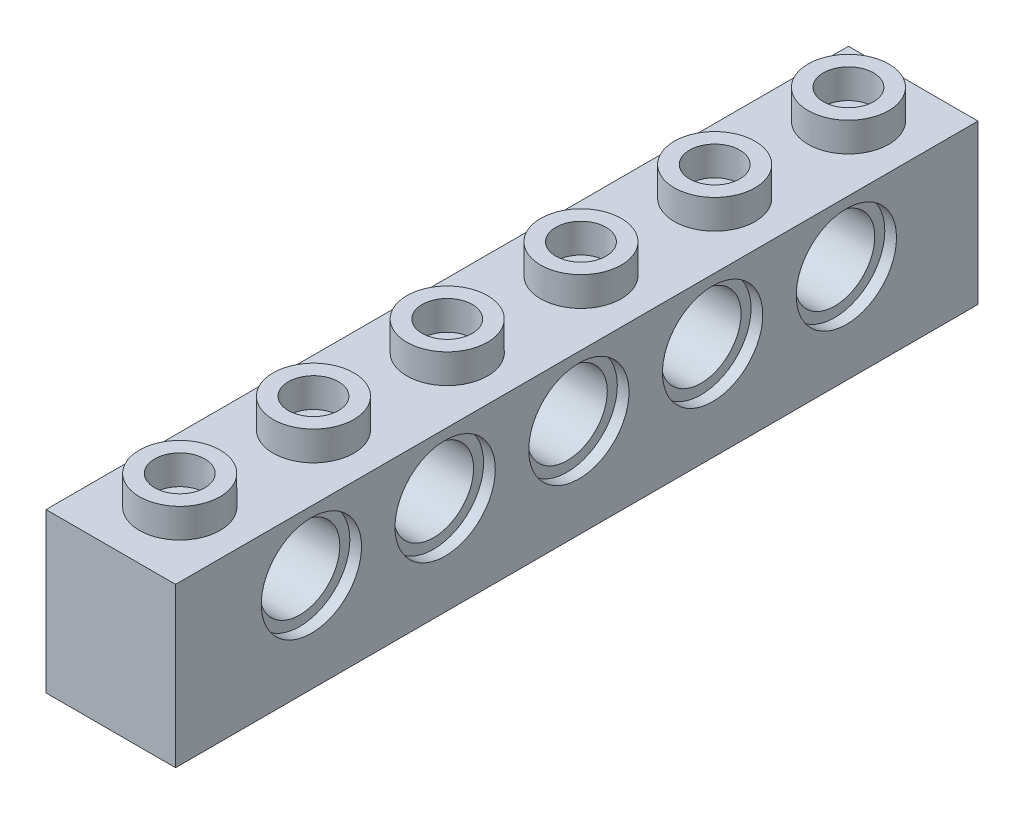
ISO-10303-21;
HEADER;
FILE_DESCRIPTION(('STEP AP214'),'2;1');
FILE_NAME('part.step','',(''),(''),'','','');
FILE_SCHEMA(('AUTOMOTIVE_DESIGN { 1 0 10303 214 1 1 1 1 }'));
ENDSEC;
DATA;
#1=APPLICATION_CONTEXT('core data for automotive mechanical design processes');
#2=APPLICATION_PROTOCOL_DEFINITION('international standard','automotive_design',2000,#1);
#3=PRODUCT_CONTEXT('',#1,'mechanical');
#4=PRODUCT('Part','Part','',(#3));
#5=PRODUCT_RELATED_PRODUCT_CATEGORY('part','',(#4));
#6=PRODUCT_DEFINITION_FORMATION('','',#4);
#7=PRODUCT_DEFINITION_CONTEXT('part definition',#1,'design');
#8=PRODUCT_DEFINITION('design','',#6,#7);
#9=PRODUCT_DEFINITION_SHAPE('','',#8);
#10=(LENGTH_UNIT() NAMED_UNIT(*) SI_UNIT(.MILLI.,.METRE.));
#11=(NAMED_UNIT(*) PLANE_ANGLE_UNIT() SI_UNIT($,.RADIAN.));
#12=(NAMED_UNIT(*) SI_UNIT($,.STERADIAN.) SOLID_ANGLE_UNIT());
#13=UNCERTAINTY_MEASURE_WITH_UNIT(LENGTH_MEASURE(1.E-05),#10,'distance_accuracy_value','');
#14=(GEOMETRIC_REPRESENTATION_CONTEXT(3) GLOBAL_UNCERTAINTY_ASSIGNED_CONTEXT((#13)) GLOBAL_UNIT_ASSIGNED_CONTEXT((#10,
#11,#12)) REPRESENTATION_CONTEXT('',''));
#15=CARTESIAN_POINT('',(0.,0.,0.));
#16=DIRECTION('',(0.,0.,1.));
#17=DIRECTION('',(1.,0.,0.));
#18=AXIS2_PLACEMENT_3D('',#15,#16,#17);
#19=CARTESIAN_POINT('',(-2.425,-3.,1.45));
#20=DIRECTION('',(0.,-1.,0.));
#21=DIRECTION('',(0.,0.,-1.));
#22=AXIS2_PLACEMENT_3D('',#19,#20,#21);
#23=PLANE('',#22);
#24=CARTESIAN_POINT('',(0.,-3.,16.4));
#25=DIRECTION('',(0.,-1.,0.));
#26=DIRECTION('',(0.,0.,-1.));
#27=AXIS2_PLACEMENT_3D('',#24,#25,#26);
#28=CIRCLE('',#27,1.5);
#29=CARTESIAN_POINT('',(0.,-3.,14.9));
#30=VERTEX_POINT('',#29);
#31=EDGE_CURVE('E340',#30,#30,#28,.T.);
#32=ORIENTED_EDGE('',*,*,#31,.F.);
#33=EDGE_LOOP('',(#32));
#34=FACE_BOUND('',#33,.T.);
#35=CARTESIAN_POINT('',(0.,-3.,32.4));
#36=DIRECTION('',(0.,-1.,0.));
#37=DIRECTION('',(0.,0.,-1.));
#38=AXIS2_PLACEMENT_3D('',#35,#36,#37);
#39=CIRCLE('',#38,1.5);
#40=CARTESIAN_POINT('',(0.,-3.,30.9));
#41=VERTEX_POINT('',#40);
#42=EDGE_CURVE('E352',#41,#41,#39,.T.);
#43=ORIENTED_EDGE('',*,*,#42,.F.);
#44=EDGE_LOOP('',(#43));
#45=FACE_BOUND('',#44,.T.);
#46=DIRECTION('',(0.,0.,-1.));
#47=VECTOR('',#46,1.);
#48=CARTESIAN_POINT('',(-2.425,-3.,46.55));
#49=LINE('',#48,#47);
#50=CARTESIAN_POINT('',(-2.425,-3.,46.55));
#51=VERTEX_POINT('',#50);
#52=CARTESIAN_POINT('',(-2.425,-3.,1.45));
#53=VERTEX_POINT('',#52);
#54=EDGE_CURVE('E115',#51,#53,#49,.T.);
#55=ORIENTED_EDGE('',*,*,#54,.T.);
#56=DIRECTION('',(1.,0.,0.));
#57=VECTOR('',#56,1.);
#58=CARTESIAN_POINT('',(-2.425,-3.,1.45));
#59=LINE('',#58,#57);
#60=CARTESIAN_POINT('',(2.425,-3.,1.45));
#61=VERTEX_POINT('',#60);
#62=EDGE_CURVE('E124',#53,#61,#59,.T.);
#63=ORIENTED_EDGE('',*,*,#62,.T.);
#64=DIRECTION('',(0.,0.,1.));
#65=VECTOR('',#64,1.);
#66=CARTESIAN_POINT('',(2.425,-3.,1.45));
#67=LINE('',#66,#65);
#68=CARTESIAN_POINT('',(2.425,-3.,46.55));
#69=VERTEX_POINT('',#68);
#70=EDGE_CURVE('E129',#61,#69,#67,.T.);
#71=ORIENTED_EDGE('',*,*,#70,.T.);
#72=DIRECTION('',(-1.,0.,0.));
#73=VECTOR('',#72,1.);
#74=CARTESIAN_POINT('',(2.425,-3.,46.55));
#75=LINE('',#74,#73);
#76=EDGE_CURVE('E121',#69,#51,#75,.T.);
#77=ORIENTED_EDGE('',*,*,#76,.T.);
#78=EDGE_LOOP('',(#55,#63,#71,#77));
#79=FACE_BOUND('',#78,.T.);
#80=CARTESIAN_POINT('',(0.,-3.,40.4));
#81=DIRECTION('',(0.,-1.,0.));
#82=DIRECTION('',(0.,0.,-1.));
#83=AXIS2_PLACEMENT_3D('',#80,#81,#82);
#84=CIRCLE('',#83,1.5);
#85=CARTESIAN_POINT('',(0.,-3.,38.9));
#86=VERTEX_POINT('',#85);
#87=EDGE_CURVE('E139',#86,#86,#84,.T.);
#88=ORIENTED_EDGE('',*,*,#87,.F.);
#89=EDGE_LOOP('',(#88));
#90=FACE_BOUND('',#89,.T.);
#91=CARTESIAN_POINT('',(0.,-3.,24.4));
#92=DIRECTION('',(0.,-1.,0.));
#93=DIRECTION('',(0.,0.,-1.));
#94=AXIS2_PLACEMENT_3D('',#91,#92,#93);
#95=CIRCLE('',#94,1.5);
#96=CARTESIAN_POINT('',(0.,-3.,22.9));
#97=VERTEX_POINT('',#96);
#98=EDGE_CURVE('E346',#97,#97,#95,.T.);
#99=ORIENTED_EDGE('',*,*,#98,.F.);
#100=EDGE_LOOP('',(#99));
#101=FACE_BOUND('',#100,.T.);
#102=CARTESIAN_POINT('',(0.,-3.,8.4));
#103=DIRECTION('',(0.,-1.,0.));
#104=DIRECTION('',(0.,0.,-1.));
#105=AXIS2_PLACEMENT_3D('',#102,#103,#104);
#106=CIRCLE('',#105,1.5);
#107=CARTESIAN_POINT('',(0.,-3.,6.9));
#108=VERTEX_POINT('',#107);
#109=EDGE_CURVE('E334',#108,#108,#106,.T.);
#110=ORIENTED_EDGE('',*,*,#109,.F.);
#111=EDGE_LOOP('',(#110));
#112=FACE_BOUND('',#111,.T.);
#113=ADVANCED_FACE('F36',(#34,#45,#79,#90,#101,#112),#23,.T.);
#114=CARTESIAN_POINT('',(3.875,4.75,48.));
#115=DIRECTION('',(0.,-1.,0.));
#116=DIRECTION('',(1.,0.,0.));
#117=AXIS2_PLACEMENT_3D('',#114,#115,#116);
#118=PLANE('',#117);
#119=DIRECTION('',(-1.,0.,0.));
#120=VECTOR('',#119,1.);
#121=CARTESIAN_POINT('',(3.875,4.75,0.));
#122=LINE('',#121,#120);
#123=CARTESIAN_POINT('',(3.875,4.75,0.));
#124=VERTEX_POINT('',#123);
#125=CARTESIAN_POINT('',(-3.875,4.75,0.));
#126=VERTEX_POINT('',#125);
#127=EDGE_CURVE('E83',#124,#126,#122,.T.);
#128=ORIENTED_EDGE('',*,*,#127,.T.);
#129=DIRECTION('',(0.,0.,-1.));
#130=VECTOR('',#129,1.);
#131=CARTESIAN_POINT('',(-3.875,4.75,48.));
#132=LINE('',#131,#130);
#133=CARTESIAN_POINT('',(-3.875,4.75,48.));
#134=VERTEX_POINT('',#133);
#135=EDGE_CURVE('E216',#134,#126,#132,.T.);
#136=ORIENTED_EDGE('',*,*,#135,.F.);
#137=DIRECTION('',(-1.,0.,0.));
#138=VECTOR('',#137,1.);
#139=CARTESIAN_POINT('',(3.875,4.75,48.));
#140=LINE('',#139,#138);
#141=CARTESIAN_POINT('',(3.875,4.75,48.));
#142=VERTEX_POINT('',#141);
#143=EDGE_CURVE('E62',#142,#134,#140,.T.);
#144=ORIENTED_EDGE('',*,*,#143,.F.);
#145=DIRECTION('',(0.,0.,-1.));
#146=VECTOR('',#145,1.);
#147=CARTESIAN_POINT('',(3.875,4.75,48.));
#148=LINE('',#147,#146);
#149=EDGE_CURVE('E225',#142,#124,#148,.T.);
#150=ORIENTED_EDGE('',*,*,#149,.T.);
#151=EDGE_LOOP('',(#128,#136,#144,#150));
#152=FACE_BOUND('',#151,.T.);
#153=CARTESIAN_POINT('',(0.,4.75,3.875));
#154=DIRECTION('',(0.,-1.,0.));
#155=DIRECTION('',(1.,0.,0.));
#156=AXIS2_PLACEMENT_3D('',#153,#154,#155);
#157=CIRCLE('',#156,2.415);
#158=CARTESIAN_POINT('',(2.415,4.75,3.875));
#159=VERTEX_POINT('',#158);
#160=EDGE_CURVE('E232',#159,#159,#157,.F.);
#161=ORIENTED_EDGE('',*,*,#160,.F.);
#162=EDGE_LOOP('',(#161));
#163=FACE_BOUND('',#162,.T.);
#164=CARTESIAN_POINT('',(0.,4.75,11.875));
#165=DIRECTION('',(0.,-1.,0.));
#166=DIRECTION('',(1.,0.,0.));
#167=AXIS2_PLACEMENT_3D('',#164,#165,#166);
#168=CIRCLE('',#167,2.415);
#169=CARTESIAN_POINT('',(2.415,4.75,11.875));
#170=VERTEX_POINT('',#169);
#171=EDGE_CURVE('E235',#170,#170,#168,.F.);
#172=ORIENTED_EDGE('',*,*,#171,.F.);
#173=EDGE_LOOP('',(#172));
#174=FACE_BOUND('',#173,.T.);
#175=CARTESIAN_POINT('',(0.,4.75,19.875));
#176=DIRECTION('',(0.,-1.,0.));
#177=DIRECTION('',(1.,0.,0.));
#178=AXIS2_PLACEMENT_3D('',#175,#176,#177);
#179=CIRCLE('',#178,2.415);
#180=CARTESIAN_POINT('',(2.415,4.75,19.875));
#181=VERTEX_POINT('',#180);
#182=EDGE_CURVE('E238',#181,#181,#179,.F.);
#183=ORIENTED_EDGE('',*,*,#182,.F.);
#184=EDGE_LOOP('',(#183));
#185=FACE_BOUND('',#184,.T.);
#186=CARTESIAN_POINT('',(0.,4.75,27.875));
#187=DIRECTION('',(0.,-1.,0.));
#188=DIRECTION('',(1.,0.,0.));
#189=AXIS2_PLACEMENT_3D('',#186,#187,#188);
#190=CIRCLE('',#189,2.415);
#191=CARTESIAN_POINT('',(2.415,4.75,27.875));
#192=VERTEX_POINT('',#191);
#193=EDGE_CURVE('E241',#192,#192,#190,.F.);
#194=ORIENTED_EDGE('',*,*,#193,.F.);
#195=EDGE_LOOP('',(#194));
#196=FACE_BOUND('',#195,.T.);
#197=CARTESIAN_POINT('',(0.,4.75,35.875));
#198=DIRECTION('',(0.,-1.,0.));
#199=DIRECTION('',(1.,0.,0.));
#200=AXIS2_PLACEMENT_3D('',#197,#198,#199);
#201=CIRCLE('',#200,2.415);
#202=CARTESIAN_POINT('',(2.415,4.75,35.875));
#203=VERTEX_POINT('',#202);
#204=EDGE_CURVE('E45',#203,#203,#201,.F.);
#205=ORIENTED_EDGE('',*,*,#204,.F.);
#206=EDGE_LOOP('',(#205));
#207=FACE_BOUND('',#206,.T.);
#208=CARTESIAN_POINT('',(0.,4.75,43.875));
#209=DIRECTION('',(0.,-1.,0.));
#210=DIRECTION('',(1.,0.,0.));
#211=AXIS2_PLACEMENT_3D('',#208,#209,#210);
#212=CIRCLE('',#211,2.415);
#213=CARTESIAN_POINT('',(2.415,4.75,43.875));
#214=VERTEX_POINT('',#213);
#215=EDGE_CURVE('E11',#214,#214,#212,.F.);
#216=ORIENTED_EDGE('',*,*,#215,.F.);
#217=EDGE_LOOP('',(#216));
#218=FACE_BOUND('',#217,.T.);
#219=ADVANCED_FACE('F368',(#152,#163,#174,#185,#196,#207,#218),#118,.F.);
#220=CARTESIAN_POINT('',(-3.875,-4.75,48.));
#221=DIRECTION('',(1.,0.,0.));
#222=DIRECTION('',(0.,0.,-1.));
#223=AXIS2_PLACEMENT_3D('',#220,#221,#222);
#224=PLANE('',#223);
#225=CARTESIAN_POINT('',(-3.875,1.15,7.87499999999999));
#226=DIRECTION('',(-1.,0.,0.));
#227=DIRECTION('',(0.,0.,1.));
#228=AXIS2_PLACEMENT_3D('',#225,#226,#227);
#229=CIRCLE('',#228,3.);
#230=CARTESIAN_POINT('',(-3.875,1.15,10.875));
#231=VERTEX_POINT('',#230);
#232=EDGE_CURVE('E297',#231,#231,#229,.T.);
#233=ORIENTED_EDGE('',*,*,#232,.F.);
#234=EDGE_LOOP('',(#233));
#235=FACE_BOUND('',#234,.T.);
#236=CARTESIAN_POINT('',(-3.875,1.15,15.875));
#237=DIRECTION('',(-1.,0.,0.));
#238=DIRECTION('',(0.,0.,1.));
#239=AXIS2_PLACEMENT_3D('',#236,#237,#238);
#240=CIRCLE('',#239,3.);
#241=CARTESIAN_POINT('',(-3.875,1.15,18.875));
#242=VERTEX_POINT('',#241);
#243=EDGE_CURVE('E303',#242,#242,#240,.T.);
#244=ORIENTED_EDGE('',*,*,#243,.F.);
#245=EDGE_LOOP('',(#244));
#246=FACE_BOUND('',#245,.T.);
#247=CARTESIAN_POINT('',(-3.875,1.15,23.875));
#248=DIRECTION('',(-1.,0.,0.));
#249=DIRECTION('',(0.,0.,1.));
#250=AXIS2_PLACEMENT_3D('',#247,#248,#249);
#251=CIRCLE('',#250,3.);
#252=CARTESIAN_POINT('',(-3.875,1.15,26.875));
#253=VERTEX_POINT('',#252);
#254=EDGE_CURVE('E309',#253,#253,#251,.T.);
#255=ORIENTED_EDGE('',*,*,#254,.F.);
#256=EDGE_LOOP('',(#255));
#257=FACE_BOUND('',#256,.T.);
#258=CARTESIAN_POINT('',(-3.875,1.15,31.875));
#259=DIRECTION('',(-1.,0.,0.));
#260=DIRECTION('',(0.,0.,1.));
#261=AXIS2_PLACEMENT_3D('',#258,#259,#260);
#262=CIRCLE('',#261,3.);
#263=CARTESIAN_POINT('',(-3.875,1.15,34.875));
#264=VERTEX_POINT('',#263);
#265=EDGE_CURVE('E315',#264,#264,#262,.T.);
#266=ORIENTED_EDGE('',*,*,#265,.F.);
#267=EDGE_LOOP('',(#266));
#268=FACE_BOUND('',#267,.T.);
#269=CARTESIAN_POINT('',(-3.875,1.15,39.875));
#270=DIRECTION('',(-1.,0.,0.));
#271=DIRECTION('',(0.,0.,1.));
#272=AXIS2_PLACEMENT_3D('',#269,#270,#271);
#273=CIRCLE('',#272,3.);
#274=CARTESIAN_POINT('',(-3.875,1.15,42.875));
#275=VERTEX_POINT('',#274);
#276=EDGE_CURVE('E328',#275,#275,#273,.T.);
#277=ORIENTED_EDGE('',*,*,#276,.F.);
#278=EDGE_LOOP('',(#277));
#279=FACE_BOUND('',#278,.T.);
#280=DIRECTION('',(0.,-1.,0.));
#281=VECTOR('',#280,1.);
#282=CARTESIAN_POINT('',(-3.875,-4.75,0.));
#283=LINE('',#282,#281);
#284=CARTESIAN_POINT('',(-3.875,-4.75,0.));
#285=VERTEX_POINT('',#284);
#286=EDGE_CURVE('E209',#126,#285,#283,.T.);
#287=ORIENTED_EDGE('',*,*,#286,.T.);
#288=DIRECTION('',(0.,0.,-1.));
#289=VECTOR('',#288,1.);
#290=CARTESIAN_POINT('',(-3.875,-4.75,48.));
#291=LINE('',#290,#289);
#292=CARTESIAN_POINT('',(-3.875,-4.75,48.));
#293=VERTEX_POINT('',#292);
#294=EDGE_CURVE('E230',#293,#285,#291,.T.);
#295=ORIENTED_EDGE('',*,*,#294,.F.);
#296=DIRECTION('',(0.,-1.,0.));
#297=VECTOR('',#296,1.);
#298=CARTESIAN_POINT('',(-3.875,-4.75,48.));
#299=LINE('',#298,#297);
#300=EDGE_CURVE('E210',#134,#293,#299,.T.);
#301=ORIENTED_EDGE('',*,*,#300,.F.);
#302=ORIENTED_EDGE('',*,*,#135,.T.);
#303=EDGE_LOOP('',(#287,#295,#301,#302));
#304=FACE_BOUND('',#303,.T.);
#305=ADVANCED_FACE('F38',(#235,#246,#257,#268,#279,#304),#224,.F.);
#306=CARTESIAN_POINT('',(3.875,-4.75,48.));
#307=DIRECTION('',(0.,1.,0.));
#308=DIRECTION('',(0.,0.,1.));
#309=AXIS2_PLACEMENT_3D('',#306,#307,#308);
#310=PLANE('',#309);
#311=DIRECTION('',(1.,0.,0.));
#312=VECTOR('',#311,1.);
#313=CARTESIAN_POINT('',(-2.425,-4.75,1.45));
#314=LINE('',#313,#312);
#315=CARTESIAN_POINT('',(-2.425,-4.75,1.45));
#316=VERTEX_POINT('',#315);
#317=CARTESIAN_POINT('',(2.425,-4.75,1.45));
#318=VERTEX_POINT('',#317);
#319=EDGE_CURVE('E145',#316,#318,#314,.T.);
#320=ORIENTED_EDGE('',*,*,#319,.F.);
#321=DIRECTION('',(0.,0.,-1.));
#322=VECTOR('',#321,1.);
#323=CARTESIAN_POINT('',(-2.425,-4.75,46.55));
#324=LINE('',#323,#322);
#325=CARTESIAN_POINT('',(-2.425,-4.75,46.55));
#326=VERTEX_POINT('',#325);
#327=EDGE_CURVE('E53',#326,#316,#324,.T.);
#328=ORIENTED_EDGE('',*,*,#327,.F.);
#329=DIRECTION('',(-1.,0.,0.));
#330=VECTOR('',#329,1.);
#331=CARTESIAN_POINT('',(2.425,-4.75,46.55));
#332=LINE('',#331,#330);
#333=CARTESIAN_POINT('',(2.425,-4.75,46.55));
#334=VERTEX_POINT('',#333);
#335=EDGE_CURVE('E133',#334,#326,#332,.T.);
#336=ORIENTED_EDGE('',*,*,#335,.F.);
#337=DIRECTION('',(0.,0.,1.));
#338=VECTOR('',#337,1.);
#339=CARTESIAN_POINT('',(2.425,-4.75,1.45));
#340=LINE('',#339,#338);
#341=EDGE_CURVE('E136',#318,#334,#340,.T.);
#342=ORIENTED_EDGE('',*,*,#341,.F.);
#343=EDGE_LOOP('',(#320,#328,#336,#342));
#344=FACE_BOUND('',#343,.T.);
#345=DIRECTION('',(1.,0.,0.));
#346=VECTOR('',#345,1.);
#347=CARTESIAN_POINT('',(3.875,-4.75,0.));
#348=LINE('',#347,#346);
#349=CARTESIAN_POINT('',(3.875,-4.75,0.));
#350=VERTEX_POINT('',#349);
#351=EDGE_CURVE('E219',#285,#350,#348,.T.);
#352=ORIENTED_EDGE('',*,*,#351,.T.);
#353=DIRECTION('',(0.,0.,-1.));
#354=VECTOR('',#353,1.);
#355=CARTESIAN_POINT('',(3.875,-4.75,48.));
#356=LINE('',#355,#354);
#357=CARTESIAN_POINT('',(3.875,-4.75,48.));
#358=VERTEX_POINT('',#357);
#359=EDGE_CURVE('E227',#358,#350,#356,.T.);
#360=ORIENTED_EDGE('',*,*,#359,.F.);
#361=DIRECTION('',(1.,0.,0.));
#362=VECTOR('',#361,1.);
#363=CARTESIAN_POINT('',(3.875,-4.75,48.));
#364=LINE('',#363,#362);
#365=EDGE_CURVE('E91',#293,#358,#364,.T.);
#366=ORIENTED_EDGE('',*,*,#365,.F.);
#367=ORIENTED_EDGE('',*,*,#294,.T.);
#368=EDGE_LOOP('',(#352,#360,#366,#367));
#369=FACE_BOUND('',#368,.T.);
#370=ADVANCED_FACE('F521',(#344,#369),#310,.F.);
#371=CARTESIAN_POINT('',(3.875,-4.75,48.));
#372=DIRECTION('',(-1.,0.,0.));
#373=DIRECTION('',(0.,0.,1.));
#374=AXIS2_PLACEMENT_3D('',#371,#372,#373);
#375=PLANE('',#374);
#376=CARTESIAN_POINT('',(3.875,1.15,7.87499999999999));
#377=DIRECTION('',(1.,0.,0.));
#378=DIRECTION('',(0.,0.,-1.));
#379=AXIS2_PLACEMENT_3D('',#376,#377,#378);
#380=CIRCLE('',#379,3.);
#381=CARTESIAN_POINT('',(3.875,1.15,4.87499999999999));
#382=VERTEX_POINT('',#381);
#383=EDGE_CURVE('E254',#382,#382,#380,.T.);
#384=ORIENTED_EDGE('',*,*,#383,.F.);
#385=EDGE_LOOP('',(#384));
#386=FACE_BOUND('',#385,.T.);
#387=CARTESIAN_POINT('',(3.875,1.15,15.875));
#388=DIRECTION('',(1.,0.,0.));
#389=DIRECTION('',(0.,0.,-1.));
#390=AXIS2_PLACEMENT_3D('',#387,#388,#389);
#391=CIRCLE('',#390,3.);
#392=CARTESIAN_POINT('',(3.875,1.15,12.875));
#393=VERTEX_POINT('',#392);
#394=EDGE_CURVE('E279',#393,#393,#391,.T.);
#395=ORIENTED_EDGE('',*,*,#394,.F.);
#396=EDGE_LOOP('',(#395));
#397=FACE_BOUND('',#396,.T.);
#398=CARTESIAN_POINT('',(3.875,1.15,23.875));
#399=DIRECTION('',(1.,0.,0.));
#400=DIRECTION('',(0.,0.,-1.));
#401=AXIS2_PLACEMENT_3D('',#398,#399,#400);
#402=CIRCLE('',#401,3.);
#403=CARTESIAN_POINT('',(3.875,1.15,20.875));
#404=VERTEX_POINT('',#403);
#405=EDGE_CURVE('E285',#404,#404,#402,.T.);
#406=ORIENTED_EDGE('',*,*,#405,.F.);
#407=EDGE_LOOP('',(#406));
#408=FACE_BOUND('',#407,.T.);
#409=CARTESIAN_POINT('',(3.875,1.15,31.875));
#410=DIRECTION('',(1.,0.,0.));
#411=DIRECTION('',(0.,0.,-1.));
#412=AXIS2_PLACEMENT_3D('',#409,#410,#411);
#413=CIRCLE('',#412,3.);
#414=CARTESIAN_POINT('',(3.875,1.15,28.875));
#415=VERTEX_POINT('',#414);
#416=EDGE_CURVE('E291',#415,#415,#413,.T.);
#417=ORIENTED_EDGE('',*,*,#416,.F.);
#418=EDGE_LOOP('',(#417));
#419=FACE_BOUND('',#418,.T.);
#420=CARTESIAN_POINT('',(3.875,1.15,39.875));
#421=DIRECTION('',(1.,0.,0.));
#422=DIRECTION('',(0.,0.,-1.));
#423=AXIS2_PLACEMENT_3D('',#420,#421,#422);
#424=CIRCLE('',#423,3.);
#425=CARTESIAN_POINT('',(3.875,1.15,36.875));
#426=VERTEX_POINT('',#425);
#427=EDGE_CURVE('E249',#426,#426,#424,.T.);
#428=ORIENTED_EDGE('',*,*,#427,.F.);
#429=EDGE_LOOP('',(#428));
#430=FACE_BOUND('',#429,.T.);
#431=DIRECTION('',(0.,1.,0.));
#432=VECTOR('',#431,1.);
#433=CARTESIAN_POINT('',(3.875,-4.75,0.));
#434=LINE('',#433,#432);
#435=EDGE_CURVE('E221',#350,#124,#434,.T.);
#436=ORIENTED_EDGE('',*,*,#435,.T.);
#437=ORIENTED_EDGE('',*,*,#149,.F.);
#438=DIRECTION('',(0.,1.,0.));
#439=VECTOR('',#438,1.);
#440=CARTESIAN_POINT('',(3.875,-4.75,48.));
#441=LINE('',#440,#439);
#442=EDGE_CURVE('E213',#358,#142,#441,.T.);
#443=ORIENTED_EDGE('',*,*,#442,.F.);
#444=ORIENTED_EDGE('',*,*,#359,.T.);
#445=EDGE_LOOP('',(#436,#437,#443,#444));
#446=FACE_BOUND('',#445,.T.);
#447=ADVANCED_FACE('F513',(#386,#397,#408,#419,#430,#446),#375,.F.);
#448=CARTESIAN_POINT('',(-3.875,4.75,48.));
#449=DIRECTION('',(0.,0.,1.));
#450=DIRECTION('',(1.,0.,0.));
#451=AXIS2_PLACEMENT_3D('',#448,#449,#450);
#452=PLANE('',#451);
#453=ORIENTED_EDGE('',*,*,#300,.T.);
#454=ORIENTED_EDGE('',*,*,#365,.T.);
#455=ORIENTED_EDGE('',*,*,#442,.T.);
#456=ORIENTED_EDGE('',*,*,#143,.T.);
#457=EDGE_LOOP('',(#453,#454,#455,#456));
#458=FACE_BOUND('',#457,.T.);
#459=ADVANCED_FACE('F510',(#458),#452,.T.);
#460=CARTESIAN_POINT('',(-3.875,4.75,0.));
#461=DIRECTION('',(0.,0.,1.));
#462=DIRECTION('',(1.,0.,0.));
#463=AXIS2_PLACEMENT_3D('',#460,#461,#462);
#464=PLANE('',#463);
#465=ORIENTED_EDGE('',*,*,#286,.F.);
#466=ORIENTED_EDGE('',*,*,#127,.F.);
#467=ORIENTED_EDGE('',*,*,#435,.F.);
#468=ORIENTED_EDGE('',*,*,#351,.F.);
#469=EDGE_LOOP('',(#465,#466,#467,#468));
#470=FACE_BOUND('',#469,.T.);
#471=ADVANCED_FACE('F505',(#470),#464,.F.);
#472=CARTESIAN_POINT('',(0.,6.5,3.875));
#473=DIRECTION('',(0.,1.,0.));
#474=DIRECTION('',(-1.,0.,0.));
#475=AXIS2_PLACEMENT_3D('',#472,#473,#474);
#476=PLANE('',#475);
#477=CARTESIAN_POINT('',(0.,6.5,3.875));
#478=DIRECTION('',(0.,1.,0.));
#479=DIRECTION('',(-1.,0.,0.));
#480=AXIS2_PLACEMENT_3D('',#477,#478,#479);
#481=CIRCLE('',#480,2.415);
#482=CARTESIAN_POINT('',(-2.415,6.5,3.875));
#483=VERTEX_POINT('',#482);
#484=EDGE_CURVE('E204',#483,#483,#481,.T.);
#485=ORIENTED_EDGE('',*,*,#484,.T.);
#486=EDGE_LOOP('',(#485));
#487=FACE_BOUND('',#486,.T.);
#488=CARTESIAN_POINT('',(0.,6.5,3.875));
#489=DIRECTION('',(0.,1.,0.));
#490=DIRECTION('',(-1.,0.,0.));
#491=AXIS2_PLACEMENT_3D('',#488,#489,#490);
#492=CIRCLE('',#491,1.5);
#493=CARTESIAN_POINT('',(-1.5,6.5,3.875));
#494=VERTEX_POINT('',#493);
#495=EDGE_CURVE('E201',#494,#494,#492,.T.);
#496=ORIENTED_EDGE('',*,*,#495,.F.);
#497=EDGE_LOOP('',(#496));
#498=FACE_BOUND('',#497,.T.);
#499=ADVANCED_FACE('F502',(#487,#498),#476,.T.);
#500=CARTESIAN_POINT('',(0.,6.5,3.875));
#501=DIRECTION('',(0.,-1.,0.));
#502=DIRECTION('',(1.,0.,0.));
#503=AXIS2_PLACEMENT_3D('',#500,#501,#502);
#504=CYLINDRICAL_SURFACE('',#503,2.415);
#505=ORIENTED_EDGE('',*,*,#484,.F.);
#506=EDGE_LOOP('',(#505));
#507=FACE_BOUND('',#506,.T.);
#508=ORIENTED_EDGE('',*,*,#160,.T.);
#509=EDGE_LOOP('',(#508));
#510=FACE_BOUND('',#509,.T.);
#511=ADVANCED_FACE('F500',(#507,#510),#504,.T.);
#512=CARTESIAN_POINT('',(0.,6.5,3.875));
#513=DIRECTION('',(0.,-1.,0.));
#514=DIRECTION('',(1.,0.,0.));
#515=AXIS2_PLACEMENT_3D('',#512,#513,#514);
#516=CYLINDRICAL_SURFACE('',#515,1.5);
#517=ORIENTED_EDGE('',*,*,#495,.T.);
#518=EDGE_LOOP('',(#517));
#519=FACE_BOUND('',#518,.T.);
#520=CARTESIAN_POINT('',(0.,4.75,3.875));
#521=DIRECTION('',(0.,1.,0.));
#522=DIRECTION('',(-1.,0.,0.));
#523=AXIS2_PLACEMENT_3D('',#520,#521,#522);
#524=CIRCLE('',#523,1.5);
#525=CARTESIAN_POINT('',(-1.5,4.75,3.875));
#526=VERTEX_POINT('',#525);
#527=EDGE_CURVE('E200',#526,#526,#524,.T.);
#528=ORIENTED_EDGE('',*,*,#527,.F.);
#529=EDGE_LOOP('',(#528));
#530=FACE_BOUND('',#529,.T.);
#531=ADVANCED_FACE('F497',(#519,#530),#516,.F.);
#532=ORIENTED_EDGE('',*,*,#527,.T.);
#533=EDGE_LOOP('',(#532));
#534=FACE_BOUND('',#533,.T.);
#535=ADVANCED_FACE('F492',(#534),#118,.F.);
#536=CARTESIAN_POINT('',(0.,6.5,11.875));
#537=DIRECTION('',(0.,1.,0.));
#538=DIRECTION('',(-1.,0.,0.));
#539=AXIS2_PLACEMENT_3D('',#536,#537,#538);
#540=PLANE('',#539);
#541=CARTESIAN_POINT('',(0.,6.5,11.875));
#542=DIRECTION('',(0.,1.,0.));
#543=DIRECTION('',(-1.,0.,0.));
#544=AXIS2_PLACEMENT_3D('',#541,#542,#543);
#545=CIRCLE('',#544,2.415);
#546=CARTESIAN_POINT('',(-2.415,6.5,11.875));
#547=VERTEX_POINT('',#546);
#548=EDGE_CURVE('E195',#547,#547,#545,.T.);
#549=ORIENTED_EDGE('',*,*,#548,.T.);
#550=EDGE_LOOP('',(#549));
#551=FACE_BOUND('',#550,.T.);
#552=CARTESIAN_POINT('',(0.,6.5,11.875));
#553=DIRECTION('',(0.,1.,0.));
#554=DIRECTION('',(-1.,0.,0.));
#555=AXIS2_PLACEMENT_3D('',#552,#553,#554);
#556=CIRCLE('',#555,1.5);
#557=CARTESIAN_POINT('',(-1.5,6.5,11.875));
#558=VERTEX_POINT('',#557);
#559=EDGE_CURVE('E192',#558,#558,#556,.T.);
#560=ORIENTED_EDGE('',*,*,#559,.F.);
#561=EDGE_LOOP('',(#560));
#562=FACE_BOUND('',#561,.T.);
#563=ADVANCED_FACE('F489',(#551,#562),#540,.T.);
#564=CARTESIAN_POINT('',(0.,6.5,11.875));
#565=DIRECTION('',(0.,-1.,0.));
#566=DIRECTION('',(1.,0.,0.));
#567=AXIS2_PLACEMENT_3D('',#564,#565,#566);
#568=CYLINDRICAL_SURFACE('',#567,2.415);
#569=ORIENTED_EDGE('',*,*,#548,.F.);
#570=EDGE_LOOP('',(#569));
#571=FACE_BOUND('',#570,.T.);
#572=ORIENTED_EDGE('',*,*,#171,.T.);
#573=EDGE_LOOP('',(#572));
#574=FACE_BOUND('',#573,.T.);
#575=ADVANCED_FACE('F487',(#571,#574),#568,.T.);
#576=CARTESIAN_POINT('',(0.,6.5,11.875));
#577=DIRECTION('',(0.,-1.,0.));
#578=DIRECTION('',(1.,0.,0.));
#579=AXIS2_PLACEMENT_3D('',#576,#577,#578);
#580=CYLINDRICAL_SURFACE('',#579,1.5);
#581=ORIENTED_EDGE('',*,*,#559,.T.);
#582=EDGE_LOOP('',(#581));
#583=FACE_BOUND('',#582,.T.);
#584=CARTESIAN_POINT('',(0.,4.75,11.875));
#585=DIRECTION('',(0.,1.,0.));
#586=DIRECTION('',(-1.,0.,0.));
#587=AXIS2_PLACEMENT_3D('',#584,#585,#586);
#588=CIRCLE('',#587,1.5);
#589=CARTESIAN_POINT('',(-1.5,4.75,11.875));
#590=VERTEX_POINT('',#589);
#591=EDGE_CURVE('E191',#590,#590,#588,.T.);
#592=ORIENTED_EDGE('',*,*,#591,.F.);
#593=EDGE_LOOP('',(#592));
#594=FACE_BOUND('',#593,.T.);
#595=ADVANCED_FACE('F484',(#583,#594),#580,.F.);
#596=ORIENTED_EDGE('',*,*,#591,.T.);
#597=EDGE_LOOP('',(#596));
#598=FACE_BOUND('',#597,.T.);
#599=ADVANCED_FACE('F479',(#598),#118,.F.);
#600=CARTESIAN_POINT('',(0.,6.5,19.875));
#601=DIRECTION('',(0.,1.,0.));
#602=DIRECTION('',(-1.,0.,0.));
#603=AXIS2_PLACEMENT_3D('',#600,#601,#602);
#604=PLANE('',#603);
#605=CARTESIAN_POINT('',(0.,6.5,19.875));
#606=DIRECTION('',(0.,1.,0.));
#607=DIRECTION('',(-1.,0.,0.));
#608=AXIS2_PLACEMENT_3D('',#605,#606,#607);
#609=CIRCLE('',#608,2.415);
#610=CARTESIAN_POINT('',(-2.415,6.5,19.875));
#611=VERTEX_POINT('',#610);
#612=EDGE_CURVE('E186',#611,#611,#609,.T.);
#613=ORIENTED_EDGE('',*,*,#612,.T.);
#614=EDGE_LOOP('',(#613));
#615=FACE_BOUND('',#614,.T.);
#616=CARTESIAN_POINT('',(0.,6.5,19.875));
#617=DIRECTION('',(0.,1.,0.));
#618=DIRECTION('',(-1.,0.,0.));
#619=AXIS2_PLACEMENT_3D('',#616,#617,#618);
#620=CIRCLE('',#619,1.5);
#621=CARTESIAN_POINT('',(-1.5,6.5,19.875));
#622=VERTEX_POINT('',#621);
#623=EDGE_CURVE('E183',#622,#622,#620,.T.);
#624=ORIENTED_EDGE('',*,*,#623,.F.);
#625=EDGE_LOOP('',(#624));
#626=FACE_BOUND('',#625,.T.);
#627=ADVANCED_FACE('F476',(#615,#626),#604,.T.);
#628=CARTESIAN_POINT('',(0.,6.5,19.875));
#629=DIRECTION('',(0.,-1.,0.));
#630=DIRECTION('',(1.,0.,0.));
#631=AXIS2_PLACEMENT_3D('',#628,#629,#630);
#632=CYLINDRICAL_SURFACE('',#631,2.415);
#633=ORIENTED_EDGE('',*,*,#612,.F.);
#634=EDGE_LOOP('',(#633));
#635=FACE_BOUND('',#634,.T.);
#636=ORIENTED_EDGE('',*,*,#182,.T.);
#637=EDGE_LOOP('',(#636));
#638=FACE_BOUND('',#637,.T.);
#639=ADVANCED_FACE('F474',(#635,#638),#632,.T.);
#640=CARTESIAN_POINT('',(0.,6.5,19.875));
#641=DIRECTION('',(0.,-1.,0.));
#642=DIRECTION('',(1.,0.,0.));
#643=AXIS2_PLACEMENT_3D('',#640,#641,#642);
#644=CYLINDRICAL_SURFACE('',#643,1.5);
#645=ORIENTED_EDGE('',*,*,#623,.T.);
#646=EDGE_LOOP('',(#645));
#647=FACE_BOUND('',#646,.T.);
#648=CARTESIAN_POINT('',(0.,4.75,19.875));
#649=DIRECTION('',(0.,1.,0.));
#650=DIRECTION('',(-1.,0.,0.));
#651=AXIS2_PLACEMENT_3D('',#648,#649,#650);
#652=CIRCLE('',#651,1.5);
#653=CARTESIAN_POINT('',(-1.5,4.75,19.875));
#654=VERTEX_POINT('',#653);
#655=EDGE_CURVE('E182',#654,#654,#652,.T.);
#656=ORIENTED_EDGE('',*,*,#655,.F.);
#657=EDGE_LOOP('',(#656));
#658=FACE_BOUND('',#657,.T.);
#659=ADVANCED_FACE('F471',(#647,#658),#644,.F.);
#660=ORIENTED_EDGE('',*,*,#655,.T.);
#661=EDGE_LOOP('',(#660));
#662=FACE_BOUND('',#661,.T.);
#663=ADVANCED_FACE('F466',(#662),#118,.F.);
#664=CARTESIAN_POINT('',(0.,6.5,27.875));
#665=DIRECTION('',(0.,1.,0.));
#666=DIRECTION('',(-1.,0.,0.));
#667=AXIS2_PLACEMENT_3D('',#664,#665,#666);
#668=PLANE('',#667);
#669=CARTESIAN_POINT('',(0.,6.5,27.875));
#670=DIRECTION('',(0.,1.,0.));
#671=DIRECTION('',(-1.,0.,0.));
#672=AXIS2_PLACEMENT_3D('',#669,#670,#671);
#673=CIRCLE('',#672,2.415);
#674=CARTESIAN_POINT('',(-2.415,6.5,27.875));
#675=VERTEX_POINT('',#674);
#676=EDGE_CURVE('E177',#675,#675,#673,.T.);
#677=ORIENTED_EDGE('',*,*,#676,.T.);
#678=EDGE_LOOP('',(#677));
#679=FACE_BOUND('',#678,.T.);
#680=CARTESIAN_POINT('',(0.,6.5,27.875));
#681=DIRECTION('',(0.,1.,0.));
#682=DIRECTION('',(-1.,0.,0.));
#683=AXIS2_PLACEMENT_3D('',#680,#681,#682);
#684=CIRCLE('',#683,1.5);
#685=CARTESIAN_POINT('',(-1.5,6.5,27.875));
#686=VERTEX_POINT('',#685);
#687=EDGE_CURVE('E174',#686,#686,#684,.T.);
#688=ORIENTED_EDGE('',*,*,#687,.F.);
#689=EDGE_LOOP('',(#688));
#690=FACE_BOUND('',#689,.T.);
#691=ADVANCED_FACE('F463',(#679,#690),#668,.T.);
#692=CARTESIAN_POINT('',(0.,6.5,27.875));
#693=DIRECTION('',(0.,-1.,0.));
#694=DIRECTION('',(1.,0.,0.));
#695=AXIS2_PLACEMENT_3D('',#692,#693,#694);
#696=CYLINDRICAL_SURFACE('',#695,2.415);
#697=ORIENTED_EDGE('',*,*,#676,.F.);
#698=EDGE_LOOP('',(#697));
#699=FACE_BOUND('',#698,.T.);
#700=ORIENTED_EDGE('',*,*,#193,.T.);
#701=EDGE_LOOP('',(#700));
#702=FACE_BOUND('',#701,.T.);
#703=ADVANCED_FACE('F461',(#699,#702),#696,.T.);
#704=CARTESIAN_POINT('',(0.,6.5,27.875));
#705=DIRECTION('',(0.,-1.,0.));
#706=DIRECTION('',(1.,0.,0.));
#707=AXIS2_PLACEMENT_3D('',#704,#705,#706);
#708=CYLINDRICAL_SURFACE('',#707,1.5);
#709=ORIENTED_EDGE('',*,*,#687,.T.);
#710=EDGE_LOOP('',(#709));
#711=FACE_BOUND('',#710,.T.);
#712=CARTESIAN_POINT('',(0.,4.75,27.875));
#713=DIRECTION('',(0.,1.,0.));
#714=DIRECTION('',(-1.,0.,0.));
#715=AXIS2_PLACEMENT_3D('',#712,#713,#714);
#716=CIRCLE('',#715,1.5);
#717=CARTESIAN_POINT('',(-1.5,4.75,27.875));
#718=VERTEX_POINT('',#717);
#719=EDGE_CURVE('E173',#718,#718,#716,.T.);
#720=ORIENTED_EDGE('',*,*,#719,.F.);
#721=EDGE_LOOP('',(#720));
#722=FACE_BOUND('',#721,.T.);
#723=ADVANCED_FACE('F458',(#711,#722),#708,.F.);
#724=ORIENTED_EDGE('',*,*,#719,.T.);
#725=EDGE_LOOP('',(#724));
#726=FACE_BOUND('',#725,.T.);
#727=ADVANCED_FACE('F453',(#726),#118,.F.);
#728=CARTESIAN_POINT('',(0.,6.5,35.875));
#729=DIRECTION('',(0.,1.,0.));
#730=DIRECTION('',(-1.,0.,0.));
#731=AXIS2_PLACEMENT_3D('',#728,#729,#730);
#732=PLANE('',#731);
#733=CARTESIAN_POINT('',(0.,6.5,35.875));
#734=DIRECTION('',(0.,1.,0.));
#735=DIRECTION('',(-1.,0.,0.));
#736=AXIS2_PLACEMENT_3D('',#733,#734,#735);
#737=CIRCLE('',#736,2.415);
#738=CARTESIAN_POINT('',(-2.415,6.5,35.875));
#739=VERTEX_POINT('',#738);
#740=EDGE_CURVE('E168',#739,#739,#737,.T.);
#741=ORIENTED_EDGE('',*,*,#740,.T.);
#742=EDGE_LOOP('',(#741));
#743=FACE_BOUND('',#742,.T.);
#744=CARTESIAN_POINT('',(0.,6.5,35.875));
#745=DIRECTION('',(0.,1.,0.));
#746=DIRECTION('',(-1.,0.,0.));
#747=AXIS2_PLACEMENT_3D('',#744,#745,#746);
#748=CIRCLE('',#747,1.5);
#749=CARTESIAN_POINT('',(-1.5,6.5,35.875));
#750=VERTEX_POINT('',#749);
#751=EDGE_CURVE('E165',#750,#750,#748,.T.);
#752=ORIENTED_EDGE('',*,*,#751,.F.);
#753=EDGE_LOOP('',(#752));
#754=FACE_BOUND('',#753,.T.);
#755=ADVANCED_FACE('F450',(#743,#754),#732,.T.);
#756=CARTESIAN_POINT('',(0.,6.5,35.875));
#757=DIRECTION('',(0.,-1.,0.));
#758=DIRECTION('',(1.,0.,0.));
#759=AXIS2_PLACEMENT_3D('',#756,#757,#758);
#760=CYLINDRICAL_SURFACE('',#759,2.415);
#761=ORIENTED_EDGE('',*,*,#740,.F.);
#762=EDGE_LOOP('',(#761));
#763=FACE_BOUND('',#762,.T.);
#764=ORIENTED_EDGE('',*,*,#204,.T.);
#765=EDGE_LOOP('',(#764));
#766=FACE_BOUND('',#765,.T.);
#767=ADVANCED_FACE('F448',(#763,#766),#760,.T.);
#768=CARTESIAN_POINT('',(0.,6.5,35.875));
#769=DIRECTION('',(0.,-1.,0.));
#770=DIRECTION('',(1.,0.,0.));
#771=AXIS2_PLACEMENT_3D('',#768,#769,#770);
#772=CYLINDRICAL_SURFACE('',#771,1.5);
#773=ORIENTED_EDGE('',*,*,#751,.T.);
#774=EDGE_LOOP('',(#773));
#775=FACE_BOUND('',#774,.T.);
#776=CARTESIAN_POINT('',(0.,4.75,35.875));
#777=DIRECTION('',(0.,1.,0.));
#778=DIRECTION('',(-1.,0.,0.));
#779=AXIS2_PLACEMENT_3D('',#776,#777,#778);
#780=CIRCLE('',#779,1.5);
#781=CARTESIAN_POINT('',(-1.5,4.75,35.875));
#782=VERTEX_POINT('',#781);
#783=EDGE_CURVE('E164',#782,#782,#780,.T.);
#784=ORIENTED_EDGE('',*,*,#783,.F.);
#785=EDGE_LOOP('',(#784));
#786=FACE_BOUND('',#785,.T.);
#787=ADVANCED_FACE('F445',(#775,#786),#772,.F.);
#788=ORIENTED_EDGE('',*,*,#783,.T.);
#789=EDGE_LOOP('',(#788));
#790=FACE_BOUND('',#789,.T.);
#791=ADVANCED_FACE('F440',(#790),#118,.F.);
#792=CARTESIAN_POINT('',(0.,6.5,43.875));
#793=DIRECTION('',(0.,1.,0.));
#794=DIRECTION('',(-1.,0.,0.));
#795=AXIS2_PLACEMENT_3D('',#792,#793,#794);
#796=PLANE('',#795);
#797=CARTESIAN_POINT('',(0.,6.5,43.875));
#798=DIRECTION('',(0.,1.,0.));
#799=DIRECTION('',(-1.,0.,0.));
#800=AXIS2_PLACEMENT_3D('',#797,#798,#799);
#801=CIRCLE('',#800,2.415);
#802=CARTESIAN_POINT('',(-2.415,6.5,43.875));
#803=VERTEX_POINT('',#802);
#804=EDGE_CURVE('E159',#803,#803,#801,.T.);
#805=ORIENTED_EDGE('',*,*,#804,.T.);
#806=EDGE_LOOP('',(#805));
#807=FACE_BOUND('',#806,.T.);
#808=CARTESIAN_POINT('',(0.,6.5,43.875));
#809=DIRECTION('',(0.,1.,0.));
#810=DIRECTION('',(-1.,0.,0.));
#811=AXIS2_PLACEMENT_3D('',#808,#809,#810);
#812=CIRCLE('',#811,1.5);
#813=CARTESIAN_POINT('',(-1.5,6.5,43.875));
#814=VERTEX_POINT('',#813);
#815=EDGE_CURVE('E156',#814,#814,#812,.T.);
#816=ORIENTED_EDGE('',*,*,#815,.F.);
#817=EDGE_LOOP('',(#816));
#818=FACE_BOUND('',#817,.T.);
#819=ADVANCED_FACE('F437',(#807,#818),#796,.T.);
#820=CARTESIAN_POINT('',(0.,6.5,43.875));
#821=DIRECTION('',(0.,-1.,0.));
#822=DIRECTION('',(1.,0.,0.));
#823=AXIS2_PLACEMENT_3D('',#820,#821,#822);
#824=CYLINDRICAL_SURFACE('',#823,2.415);
#825=ORIENTED_EDGE('',*,*,#804,.F.);
#826=EDGE_LOOP('',(#825));
#827=FACE_BOUND('',#826,.T.);
#828=ORIENTED_EDGE('',*,*,#215,.T.);
#829=EDGE_LOOP('',(#828));
#830=FACE_BOUND('',#829,.T.);
#831=ADVANCED_FACE('F435',(#827,#830),#824,.T.);
#832=CARTESIAN_POINT('',(0.,6.5,43.875));
#833=DIRECTION('',(0.,-1.,0.));
#834=DIRECTION('',(1.,0.,0.));
#835=AXIS2_PLACEMENT_3D('',#832,#833,#834);
#836=CYLINDRICAL_SURFACE('',#835,1.5);
#837=ORIENTED_EDGE('',*,*,#815,.T.);
#838=EDGE_LOOP('',(#837));
#839=FACE_BOUND('',#838,.T.);
#840=CARTESIAN_POINT('',(0.,4.75,43.875));
#841=DIRECTION('',(0.,1.,0.));
#842=DIRECTION('',(-1.,0.,0.));
#843=AXIS2_PLACEMENT_3D('',#840,#841,#842);
#844=CIRCLE('',#843,1.5);
#845=CARTESIAN_POINT('',(-1.5,4.75,43.875));
#846=VERTEX_POINT('',#845);
#847=EDGE_CURVE('E152',#846,#846,#844,.T.);
#848=ORIENTED_EDGE('',*,*,#847,.F.);
#849=EDGE_LOOP('',(#848));
#850=FACE_BOUND('',#849,.T.);
#851=ADVANCED_FACE('F432',(#839,#850),#836,.F.);
#852=ORIENTED_EDGE('',*,*,#847,.T.);
#853=EDGE_LOOP('',(#852));
#854=FACE_BOUND('',#853,.T.);
#855=ADVANCED_FACE('F431',(#854),#118,.F.);
#856=CARTESIAN_POINT('',(-2.425,-3.,46.55));
#857=DIRECTION('',(-1.,0.,0.));
#858=DIRECTION('',(0.,0.,1.));
#859=AXIS2_PLACEMENT_3D('',#856,#857,#858);
#860=PLANE('',#859);
#861=ORIENTED_EDGE('',*,*,#327,.T.);
#862=DIRECTION('',(0.,-1.,0.));
#863=VECTOR('',#862,1.);
#864=CARTESIAN_POINT('',(-2.425,-3.,1.45));
#865=LINE('',#864,#863);
#866=EDGE_CURVE('E111',#53,#316,#865,.T.);
#867=ORIENTED_EDGE('',*,*,#866,.F.);
#868=ORIENTED_EDGE('',*,*,#54,.F.);
#869=DIRECTION('',(0.,-1.,0.));
#870=VECTOR('',#869,1.);
#871=CARTESIAN_POINT('',(-2.425,-3.,46.55));
#872=LINE('',#871,#870);
#873=EDGE_CURVE('E150',#51,#326,#872,.T.);
#874=ORIENTED_EDGE('',*,*,#873,.T.);
#875=EDGE_LOOP('',(#861,#867,#868,#874));
#876=FACE_BOUND('',#875,.T.);
#877=ADVANCED_FACE('F113',(#876),#860,.F.);
#878=CARTESIAN_POINT('',(2.425,-3.,46.55));
#879=DIRECTION('',(0.,0.,1.));
#880=DIRECTION('',(1.,0.,0.));
#881=AXIS2_PLACEMENT_3D('',#878,#879,#880);
#882=PLANE('',#881);
#883=ORIENTED_EDGE('',*,*,#335,.T.);
#884=ORIENTED_EDGE('',*,*,#873,.F.);
#885=ORIENTED_EDGE('',*,*,#76,.F.);
#886=DIRECTION('',(0.,-1.,0.));
#887=VECTOR('',#886,1.);
#888=CARTESIAN_POINT('',(2.425,-3.,46.55));
#889=LINE('',#888,#887);
#890=EDGE_CURVE('E153',#69,#334,#889,.T.);
#891=ORIENTED_EDGE('',*,*,#890,.T.);
#892=EDGE_LOOP('',(#883,#884,#885,#891));
#893=FACE_BOUND('',#892,.T.);
#894=ADVANCED_FACE('F419',(#893),#882,.F.);
#895=CARTESIAN_POINT('',(2.425,-3.,1.45));
#896=DIRECTION('',(1.,0.,0.));
#897=DIRECTION('',(0.,0.,-1.));
#898=AXIS2_PLACEMENT_3D('',#895,#896,#897);
#899=PLANE('',#898);
#900=ORIENTED_EDGE('',*,*,#341,.T.);
#901=ORIENTED_EDGE('',*,*,#890,.F.);
#902=ORIENTED_EDGE('',*,*,#70,.F.);
#903=DIRECTION('',(0.,-1.,0.));
#904=VECTOR('',#903,1.);
#905=CARTESIAN_POINT('',(2.425,-3.,1.45));
#906=LINE('',#905,#904);
#907=EDGE_CURVE('E120',#61,#318,#906,.T.);
#908=ORIENTED_EDGE('',*,*,#907,.T.);
#909=EDGE_LOOP('',(#900,#901,#902,#908));
#910=FACE_BOUND('',#909,.T.);
#911=ADVANCED_FACE('F422',(#910),#899,.F.);
#912=CARTESIAN_POINT('',(-2.425,-3.,1.45));
#913=DIRECTION('',(0.,0.,-1.));
#914=DIRECTION('',(-1.,0.,0.));
#915=AXIS2_PLACEMENT_3D('',#912,#913,#914);
#916=PLANE('',#915);
#917=ORIENTED_EDGE('',*,*,#319,.T.);
#918=ORIENTED_EDGE('',*,*,#907,.F.);
#919=ORIENTED_EDGE('',*,*,#62,.F.);
#920=ORIENTED_EDGE('',*,*,#866,.T.);
#921=EDGE_LOOP('',(#917,#918,#919,#920));
#922=FACE_BOUND('',#921,.T.);
#923=ADVANCED_FACE('F125',(#922),#916,.F.);
#924=CARTESIAN_POINT('',(0.,-4.75,40.4));
#925=DIRECTION('',(0.,1.,0.));
#926=DIRECTION('',(0.,0.,1.));
#927=AXIS2_PLACEMENT_3D('',#924,#925,#926);
#928=CYLINDRICAL_SURFACE('',#927,1.5);
#929=CARTESIAN_POINT('',(0.,-4.75,40.4));
#930=DIRECTION('',(0.,-1.,0.));
#931=DIRECTION('',(0.,0.,-1.));
#932=AXIS2_PLACEMENT_3D('',#929,#930,#931);
#933=CIRCLE('',#932,1.5);
#934=CARTESIAN_POINT('',(0.,-4.75,38.9));
#935=VERTEX_POINT('',#934);
#936=EDGE_CURVE('E146',#935,#935,#933,.T.);
#937=ORIENTED_EDGE('',*,*,#936,.F.);
#938=EDGE_LOOP('',(#937));
#939=FACE_BOUND('',#938,.T.);
#940=ORIENTED_EDGE('',*,*,#87,.T.);
#941=EDGE_LOOP('',(#940));
#942=FACE_BOUND('',#941,.T.);
#943=ADVANCED_FACE('F365',(#939,#942),#928,.T.);
#944=CARTESIAN_POINT('',(0.,-4.75,40.4));
#945=DIRECTION('',(0.,-1.,0.));
#946=DIRECTION('',(0.,0.,-1.));
#947=AXIS2_PLACEMENT_3D('',#944,#945,#946);
#948=PLANE('',#947);
#949=ORIENTED_EDGE('',*,*,#936,.T.);
#950=EDGE_LOOP('',(#949));
#951=FACE_BOUND('',#950,.T.);
#952=ADVANCED_FACE('F412',(#951),#948,.T.);
#953=CARTESIAN_POINT('',(0.,-4.75,32.4));
#954=DIRECTION('',(0.,1.,0.));
#955=DIRECTION('',(0.,0.,1.));
#956=AXIS2_PLACEMENT_3D('',#953,#954,#955);
#957=CYLINDRICAL_SURFACE('',#956,1.5);
#958=CARTESIAN_POINT('',(0.,-4.75,32.4));
#959=DIRECTION('',(0.,-1.,0.));
#960=DIRECTION('',(0.,0.,-1.));
#961=AXIS2_PLACEMENT_3D('',#958,#959,#960);
#962=CIRCLE('',#961,1.5);
#963=CARTESIAN_POINT('',(0.,-4.75,30.9));
#964=VERTEX_POINT('',#963);
#965=EDGE_CURVE('E355',#964,#964,#962,.T.);
#966=ORIENTED_EDGE('',*,*,#965,.F.);
#967=EDGE_LOOP('',(#966));
#968=FACE_BOUND('',#967,.T.);
#969=ORIENTED_EDGE('',*,*,#42,.T.);
#970=EDGE_LOOP('',(#969));
#971=FACE_BOUND('',#970,.T.);
#972=ADVANCED_FACE('F408',(#968,#971),#957,.T.);
#973=CARTESIAN_POINT('',(0.,-4.75,32.4));
#974=DIRECTION('',(0.,-1.,0.));
#975=DIRECTION('',(0.,0.,-1.));
#976=AXIS2_PLACEMENT_3D('',#973,#974,#975);
#977=PLANE('',#976);
#978=ORIENTED_EDGE('',*,*,#965,.T.);
#979=EDGE_LOOP('',(#978));
#980=FACE_BOUND('',#979,.T.);
#981=ADVANCED_FACE('F404',(#980),#977,.T.);
#982=CARTESIAN_POINT('',(0.,-4.75,24.4));
#983=DIRECTION('',(0.,1.,0.));
#984=DIRECTION('',(0.,0.,1.));
#985=AXIS2_PLACEMENT_3D('',#982,#983,#984);
#986=CYLINDRICAL_SURFACE('',#985,1.5);
#987=CARTESIAN_POINT('',(0.,-4.75,24.4));
#988=DIRECTION('',(0.,-1.,0.));
#989=DIRECTION('',(0.,0.,-1.));
#990=AXIS2_PLACEMENT_3D('',#987,#988,#989);
#991=CIRCLE('',#990,1.5);
#992=CARTESIAN_POINT('',(0.,-4.75,22.9));
#993=VERTEX_POINT('',#992);
#994=EDGE_CURVE('E349',#993,#993,#991,.T.);
#995=ORIENTED_EDGE('',*,*,#994,.F.);
#996=EDGE_LOOP('',(#995));
#997=FACE_BOUND('',#996,.T.);
#998=ORIENTED_EDGE('',*,*,#98,.T.);
#999=EDGE_LOOP('',(#998));
#1000=FACE_BOUND('',#999,.T.);
#1001=ADVANCED_FACE('F400',(#997,#1000),#986,.T.);
#1002=CARTESIAN_POINT('',(0.,-4.75,24.4));
#1003=DIRECTION('',(0.,-1.,0.));
#1004=DIRECTION('',(0.,0.,-1.));
#1005=AXIS2_PLACEMENT_3D('',#1002,#1003,#1004);
#1006=PLANE('',#1005);
#1007=ORIENTED_EDGE('',*,*,#994,.T.);
#1008=EDGE_LOOP('',(#1007));
#1009=FACE_BOUND('',#1008,.T.);
#1010=ADVANCED_FACE('F396',(#1009),#1006,.T.);
#1011=CARTESIAN_POINT('',(0.,-4.75,16.4));
#1012=DIRECTION('',(0.,1.,0.));
#1013=DIRECTION('',(0.,0.,1.));
#1014=AXIS2_PLACEMENT_3D('',#1011,#1012,#1013);
#1015=CYLINDRICAL_SURFACE('',#1014,1.5);
#1016=CARTESIAN_POINT('',(0.,-4.75,16.4));
#1017=DIRECTION('',(0.,-1.,0.));
#1018=DIRECTION('',(0.,0.,-1.));
#1019=AXIS2_PLACEMENT_3D('',#1016,#1017,#1018);
#1020=CIRCLE('',#1019,1.5);
#1021=CARTESIAN_POINT('',(0.,-4.75,14.9));
#1022=VERTEX_POINT('',#1021);
#1023=EDGE_CURVE('E343',#1022,#1022,#1020,.T.);
#1024=ORIENTED_EDGE('',*,*,#1023,.F.);
#1025=EDGE_LOOP('',(#1024));
#1026=FACE_BOUND('',#1025,.T.);
#1027=ORIENTED_EDGE('',*,*,#31,.T.);
#1028=EDGE_LOOP('',(#1027));
#1029=FACE_BOUND('',#1028,.T.);
#1030=ADVANCED_FACE('F388',(#1026,#1029),#1015,.T.);
#1031=CARTESIAN_POINT('',(0.,-4.75,16.4));
#1032=DIRECTION('',(0.,-1.,0.));
#1033=DIRECTION('',(0.,0.,-1.));
#1034=AXIS2_PLACEMENT_3D('',#1031,#1032,#1033);
#1035=PLANE('',#1034);
#1036=ORIENTED_EDGE('',*,*,#1023,.T.);
#1037=EDGE_LOOP('',(#1036));
#1038=FACE_BOUND('',#1037,.T.);
#1039=ADVANCED_FACE('F378',(#1038),#1035,.T.);
#1040=CARTESIAN_POINT('',(0.,-4.75,8.4));
#1041=DIRECTION('',(0.,1.,0.));
#1042=DIRECTION('',(0.,0.,1.));
#1043=AXIS2_PLACEMENT_3D('',#1040,#1041,#1042);
#1044=CYLINDRICAL_SURFACE('',#1043,1.5);
#1045=CARTESIAN_POINT('',(0.,-4.75,8.4));
#1046=DIRECTION('',(0.,-1.,0.));
#1047=DIRECTION('',(0.,0.,-1.));
#1048=AXIS2_PLACEMENT_3D('',#1045,#1046,#1047);
#1049=CIRCLE('',#1048,1.5);
#1050=CARTESIAN_POINT('',(0.,-4.75,6.9));
#1051=VERTEX_POINT('',#1050);
#1052=EDGE_CURVE('E337',#1051,#1051,#1049,.T.);
#1053=ORIENTED_EDGE('',*,*,#1052,.F.);
#1054=EDGE_LOOP('',(#1053));
#1055=FACE_BOUND('',#1054,.T.);
#1056=ORIENTED_EDGE('',*,*,#109,.T.);
#1057=EDGE_LOOP('',(#1056));
#1058=FACE_BOUND('',#1057,.T.);
#1059=ADVANCED_FACE('F375',(#1055,#1058),#1044,.T.);
#1060=CARTESIAN_POINT('',(0.,-4.75,8.4));
#1061=DIRECTION('',(0.,-1.,0.));
#1062=DIRECTION('',(0.,0.,-1.));
#1063=AXIS2_PLACEMENT_3D('',#1060,#1061,#1062);
#1064=PLANE('',#1063);
#1065=ORIENTED_EDGE('',*,*,#1052,.T.);
#1066=EDGE_LOOP('',(#1065));
#1067=FACE_BOUND('',#1066,.T.);
#1068=ADVANCED_FACE('F377',(#1067),#1064,.T.);
#1069=CARTESIAN_POINT('',(-3.175,1.15,39.875));
#1070=DIRECTION('',(-1.,0.,0.));
#1071=DIRECTION('',(0.,0.,1.));
#1072=AXIS2_PLACEMENT_3D('',#1069,#1070,#1071);
#1073=CYLINDRICAL_SURFACE('',#1072,3.);
#1074=CARTESIAN_POINT('',(-3.175,1.15,39.875));
#1075=DIRECTION('',(-1.,0.,0.));
#1076=DIRECTION('',(0.,0.,1.));
#1077=AXIS2_PLACEMENT_3D('',#1074,#1075,#1076);
#1078=CIRCLE('',#1077,3.);
#1079=CARTESIAN_POINT('',(-3.175,1.15,42.875));
#1080=VERTEX_POINT('',#1079);
#1081=EDGE_CURVE('E331',#1080,#1080,#1078,.T.);
#1082=ORIENTED_EDGE('',*,*,#1081,.F.);
#1083=EDGE_LOOP('',(#1082));
#1084=FACE_BOUND('',#1083,.T.);
#1085=ORIENTED_EDGE('',*,*,#276,.T.);
#1086=EDGE_LOOP('',(#1085));
#1087=FACE_BOUND('',#1086,.T.);
#1088=ADVANCED_FACE('F385',(#1084,#1087),#1073,.F.);
#1089=CARTESIAN_POINT('',(-3.175,1.15,39.875));
#1090=DIRECTION('',(-1.,0.,0.));
#1091=DIRECTION('',(0.,0.,1.));
#1092=AXIS2_PLACEMENT_3D('',#1089,#1090,#1091);
#1093=PLANE('',#1092);
#1094=CARTESIAN_POINT('',(-3.175,1.15,39.875));
#1095=DIRECTION('',(-1.,0.,0.));
#1096=DIRECTION('',(0.,0.,1.));
#1097=AXIS2_PLACEMENT_3D('',#1094,#1095,#1096);
#1098=CIRCLE('',#1097,2.4);
#1099=CARTESIAN_POINT('',(-3.175,1.15,42.275));
#1100=VERTEX_POINT('',#1099);
#1101=EDGE_CURVE('E250',#1100,#1100,#1098,.T.);
#1102=ORIENTED_EDGE('',*,*,#1101,.F.);
#1103=EDGE_LOOP('',(#1102));
#1104=FACE_BOUND('',#1103,.T.);
#1105=ORIENTED_EDGE('',*,*,#1081,.T.);
#1106=EDGE_LOOP('',(#1105));
#1107=FACE_BOUND('',#1106,.T.);
#1108=ADVANCED_FACE('F770',(#1104,#1107),#1093,.T.);
#1109=CARTESIAN_POINT('',(3.175,1.15,39.875));
#1110=DIRECTION('',(1.,0.,0.));
#1111=DIRECTION('',(0.,0.,-1.));
#1112=AXIS2_PLACEMENT_3D('',#1109,#1110,#1111);
#1113=CYLINDRICAL_SURFACE('',#1112,3.);
#1114=CARTESIAN_POINT('',(3.175,1.15,39.875));
#1115=DIRECTION('',(1.,0.,0.));
#1116=DIRECTION('',(0.,0.,-1.));
#1117=AXIS2_PLACEMENT_3D('',#1114,#1115,#1116);
#1118=CIRCLE('',#1117,3.);
#1119=CARTESIAN_POINT('',(3.175,1.15,36.875));
#1120=VERTEX_POINT('',#1119);
#1121=EDGE_CURVE('E325',#1120,#1120,#1118,.T.);
#1122=ORIENTED_EDGE('',*,*,#1121,.F.);
#1123=EDGE_LOOP('',(#1122));
#1124=FACE_BOUND('',#1123,.T.);
#1125=ORIENTED_EDGE('',*,*,#427,.T.);
#1126=EDGE_LOOP('',(#1125));
#1127=FACE_BOUND('',#1126,.T.);
#1128=ADVANCED_FACE('F777',(#1124,#1127),#1113,.F.);
#1129=CARTESIAN_POINT('',(3.175,1.15,39.875));
#1130=DIRECTION('',(1.,0.,0.));
#1131=DIRECTION('',(0.,0.,-1.));
#1132=AXIS2_PLACEMENT_3D('',#1129,#1130,#1131);
#1133=PLANE('',#1132);
#1134=CARTESIAN_POINT('',(3.175,1.15,39.875));
#1135=DIRECTION('',(1.,0.,0.));
#1136=DIRECTION('',(0.,0.,-1.));
#1137=AXIS2_PLACEMENT_3D('',#1134,#1135,#1136);
#1138=CIRCLE('',#1137,2.4);
#1139=CARTESIAN_POINT('',(3.175,1.15,37.475));
#1140=VERTEX_POINT('',#1139);
#1141=EDGE_CURVE('E246',#1140,#1140,#1138,.T.);
#1142=ORIENTED_EDGE('',*,*,#1141,.F.);
#1143=EDGE_LOOP('',(#1142));
#1144=FACE_BOUND('',#1143,.T.);
#1145=ORIENTED_EDGE('',*,*,#1121,.T.);
#1146=EDGE_LOOP('',(#1145));
#1147=FACE_BOUND('',#1146,.T.);
#1148=ADVANCED_FACE('F782',(#1144,#1147),#1133,.T.);
#1149=CARTESIAN_POINT('',(3.875,1.15,39.875));
#1150=DIRECTION('',(-1.,0.,0.));
#1151=DIRECTION('',(0.,0.,1.));
#1152=AXIS2_PLACEMENT_3D('',#1149,#1150,#1151);
#1153=CYLINDRICAL_SURFACE('',#1152,2.4);
#1154=ORIENTED_EDGE('',*,*,#1141,.T.);
#1155=EDGE_LOOP('',(#1154));
#1156=FACE_BOUND('',#1155,.T.);
#1157=ORIENTED_EDGE('',*,*,#1101,.T.);
#1158=EDGE_LOOP('',(#1157));
#1159=FACE_BOUND('',#1158,.T.);
#1160=ADVANCED_FACE('F799',(#1156,#1159),#1153,.F.);
#1161=CARTESIAN_POINT('',(-3.175,1.15,31.875));
#1162=DIRECTION('',(-1.,0.,0.));
#1163=DIRECTION('',(0.,0.,1.));
#1164=AXIS2_PLACEMENT_3D('',#1161,#1162,#1163);
#1165=CYLINDRICAL_SURFACE('',#1164,3.);
#1166=CARTESIAN_POINT('',(-3.175,1.15,31.875));
#1167=DIRECTION('',(-1.,0.,0.));
#1168=DIRECTION('',(0.,0.,1.));
#1169=AXIS2_PLACEMENT_3D('',#1166,#1167,#1168);
#1170=CIRCLE('',#1169,3.);
#1171=CARTESIAN_POINT('',(-3.175,1.15,34.875));
#1172=VERTEX_POINT('',#1171);
#1173=EDGE_CURVE('E318',#1172,#1172,#1170,.T.);
#1174=ORIENTED_EDGE('',*,*,#1173,.F.);
#1175=EDGE_LOOP('',(#1174));
#1176=FACE_BOUND('',#1175,.T.);
#1177=ORIENTED_EDGE('',*,*,#265,.T.);
#1178=EDGE_LOOP('',(#1177));
#1179=FACE_BOUND('',#1178,.T.);
#1180=ADVANCED_FACE('F809',(#1176,#1179),#1165,.F.);
#1181=CARTESIAN_POINT('',(-3.175,1.15,31.875));
#1182=DIRECTION('',(-1.,0.,0.));
#1183=DIRECTION('',(0.,0.,1.));
#1184=AXIS2_PLACEMENT_3D('',#1181,#1182,#1183);
#1185=PLANE('',#1184);
#1186=CARTESIAN_POINT('',(-3.175,1.15,31.875));
#1187=DIRECTION('',(-1.,0.,0.));
#1188=DIRECTION('',(0.,0.,1.));
#1189=AXIS2_PLACEMENT_3D('',#1186,#1187,#1188);
#1190=CIRCLE('',#1189,2.4);
#1191=CARTESIAN_POINT('',(-3.175,1.15,34.275));
#1192=VERTEX_POINT('',#1191);
#1193=EDGE_CURVE('E255',#1192,#1192,#1190,.T.);
#1194=ORIENTED_EDGE('',*,*,#1193,.F.);
#1195=EDGE_LOOP('',(#1194));
#1196=FACE_BOUND('',#1195,.T.);
#1197=ORIENTED_EDGE('',*,*,#1173,.T.);
#1198=EDGE_LOOP('',(#1197));
#1199=FACE_BOUND('',#1198,.T.);
#1200=ADVANCED_FACE('F830',(#1196,#1199),#1185,.T.);
#1201=CARTESIAN_POINT('',(-3.175,1.15,23.875));
#1202=DIRECTION('',(-1.,0.,0.));
#1203=DIRECTION('',(0.,0.,1.));
#1204=AXIS2_PLACEMENT_3D('',#1201,#1202,#1203);
#1205=CYLINDRICAL_SURFACE('',#1204,3.);
#1206=CARTESIAN_POINT('',(-3.175,1.15,23.875));
#1207=DIRECTION('',(-1.,0.,0.));
#1208=DIRECTION('',(0.,0.,1.));
#1209=AXIS2_PLACEMENT_3D('',#1206,#1207,#1208);
#1210=CIRCLE('',#1209,3.);
#1211=CARTESIAN_POINT('',(-3.175,1.15,26.875));
#1212=VERTEX_POINT('',#1211);
#1213=EDGE_CURVE('E312',#1212,#1212,#1210,.T.);
#1214=ORIENTED_EDGE('',*,*,#1213,.F.);
#1215=EDGE_LOOP('',(#1214));
#1216=FACE_BOUND('',#1215,.T.);
#1217=ORIENTED_EDGE('',*,*,#254,.T.);
#1218=EDGE_LOOP('',(#1217));
#1219=FACE_BOUND('',#1218,.T.);
#1220=ADVANCED_FACE('F840',(#1216,#1219),#1205,.F.);
#1221=CARTESIAN_POINT('',(-3.175,1.15,23.875));
#1222=DIRECTION('',(-1.,0.,0.));
#1223=DIRECTION('',(0.,0.,1.));
#1224=AXIS2_PLACEMENT_3D('',#1221,#1222,#1223);
#1225=PLANE('',#1224);
#1226=CARTESIAN_POINT('',(-3.175,1.15,23.875));
#1227=DIRECTION('',(-1.,0.,0.));
#1228=DIRECTION('',(0.,0.,1.));
#1229=AXIS2_PLACEMENT_3D('',#1226,#1227,#1228);
#1230=CIRCLE('',#1229,2.4);
#1231=CARTESIAN_POINT('',(-3.175,1.15,26.275));
#1232=VERTEX_POINT('',#1231);
#1233=EDGE_CURVE('E258',#1232,#1232,#1230,.T.);
#1234=ORIENTED_EDGE('',*,*,#1233,.F.);
#1235=EDGE_LOOP('',(#1234));
#1236=FACE_BOUND('',#1235,.T.);
#1237=ORIENTED_EDGE('',*,*,#1213,.T.);
#1238=EDGE_LOOP('',(#1237));
#1239=FACE_BOUND('',#1238,.T.);
#1240=ADVANCED_FACE('F850',(#1236,#1239),#1225,.T.);
#1241=CARTESIAN_POINT('',(-3.175,1.15,15.875));
#1242=DIRECTION('',(-1.,0.,0.));
#1243=DIRECTION('',(0.,0.,1.));
#1244=AXIS2_PLACEMENT_3D('',#1241,#1242,#1243);
#1245=CYLINDRICAL_SURFACE('',#1244,3.);
#1246=CARTESIAN_POINT('',(-3.175,1.15,15.875));
#1247=DIRECTION('',(-1.,0.,0.));
#1248=DIRECTION('',(0.,0.,1.));
#1249=AXIS2_PLACEMENT_3D('',#1246,#1247,#1248);
#1250=CIRCLE('',#1249,3.);
#1251=CARTESIAN_POINT('',(-3.175,1.15,18.875));
#1252=VERTEX_POINT('',#1251);
#1253=EDGE_CURVE('E306',#1252,#1252,#1250,.T.);
#1254=ORIENTED_EDGE('',*,*,#1253,.F.);
#1255=EDGE_LOOP('',(#1254));
#1256=FACE_BOUND('',#1255,.T.);
#1257=ORIENTED_EDGE('',*,*,#243,.T.);
#1258=EDGE_LOOP('',(#1257));
#1259=FACE_BOUND('',#1258,.T.);
#1260=ADVANCED_FACE('F860',(#1256,#1259),#1245,.F.);
#1261=CARTESIAN_POINT('',(-3.175,1.15,15.875));
#1262=DIRECTION('',(-1.,0.,0.));
#1263=DIRECTION('',(0.,0.,1.));
#1264=AXIS2_PLACEMENT_3D('',#1261,#1262,#1263);
#1265=PLANE('',#1264);
#1266=CARTESIAN_POINT('',(-3.175,1.15,15.875));
#1267=DIRECTION('',(-1.,0.,0.));
#1268=DIRECTION('',(0.,0.,1.));
#1269=AXIS2_PLACEMENT_3D('',#1266,#1267,#1268);
#1270=CIRCLE('',#1269,2.4);
#1271=CARTESIAN_POINT('',(-3.175,1.15,18.275));
#1272=VERTEX_POINT('',#1271);
#1273=EDGE_CURVE('E261',#1272,#1272,#1270,.T.);
#1274=ORIENTED_EDGE('',*,*,#1273,.F.);
#1275=EDGE_LOOP('',(#1274));
#1276=FACE_BOUND('',#1275,.T.);
#1277=ORIENTED_EDGE('',*,*,#1253,.T.);
#1278=EDGE_LOOP('',(#1277));
#1279=FACE_BOUND('',#1278,.T.);
#1280=ADVANCED_FACE('F870',(#1276,#1279),#1265,.T.);
#1281=CARTESIAN_POINT('',(-3.175,1.15,7.87499999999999));
#1282=DIRECTION('',(-1.,0.,0.));
#1283=DIRECTION('',(0.,0.,1.));
#1284=AXIS2_PLACEMENT_3D('',#1281,#1282,#1283);
#1285=CYLINDRICAL_SURFACE('',#1284,3.);
#1286=CARTESIAN_POINT('',(-3.175,1.15,7.87499999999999));
#1287=DIRECTION('',(-1.,0.,0.));
#1288=DIRECTION('',(0.,0.,1.));
#1289=AXIS2_PLACEMENT_3D('',#1286,#1287,#1288);
#1290=CIRCLE('',#1289,3.);
#1291=CARTESIAN_POINT('',(-3.175,1.15,10.875));
#1292=VERTEX_POINT('',#1291);
#1293=EDGE_CURVE('E300',#1292,#1292,#1290,.T.);
#1294=ORIENTED_EDGE('',*,*,#1293,.F.);
#1295=EDGE_LOOP('',(#1294));
#1296=FACE_BOUND('',#1295,.T.);
#1297=ORIENTED_EDGE('',*,*,#232,.T.);
#1298=EDGE_LOOP('',(#1297));
#1299=FACE_BOUND('',#1298,.T.);
#1300=ADVANCED_FACE('F880',(#1296,#1299),#1285,.F.);
#1301=CARTESIAN_POINT('',(-3.175,1.15,7.87499999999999));
#1302=DIRECTION('',(-1.,0.,0.));
#1303=DIRECTION('',(0.,0.,1.));
#1304=AXIS2_PLACEMENT_3D('',#1301,#1302,#1303);
#1305=PLANE('',#1304);
#1306=CARTESIAN_POINT('',(-3.175,1.15,7.87499999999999));
#1307=DIRECTION('',(-1.,0.,0.));
#1308=DIRECTION('',(0.,0.,1.));
#1309=AXIS2_PLACEMENT_3D('',#1306,#1307,#1308);
#1310=CIRCLE('',#1309,2.4);
#1311=CARTESIAN_POINT('',(-3.175,1.15,10.275));
#1312=VERTEX_POINT('',#1311);
#1313=EDGE_CURVE('E271',#1312,#1312,#1310,.T.);
#1314=ORIENTED_EDGE('',*,*,#1313,.F.);
#1315=EDGE_LOOP('',(#1314));
#1316=FACE_BOUND('',#1315,.T.);
#1317=ORIENTED_EDGE('',*,*,#1293,.T.);
#1318=EDGE_LOOP('',(#1317));
#1319=FACE_BOUND('',#1318,.T.);
#1320=ADVANCED_FACE('F890',(#1316,#1319),#1305,.T.);
#1321=CARTESIAN_POINT('',(3.175,1.15,31.875));
#1322=DIRECTION('',(1.,0.,0.));
#1323=DIRECTION('',(0.,0.,-1.));
#1324=AXIS2_PLACEMENT_3D('',#1321,#1322,#1323);
#1325=CYLINDRICAL_SURFACE('',#1324,3.);
#1326=CARTESIAN_POINT('',(3.175,1.15,31.875));
#1327=DIRECTION('',(1.,0.,0.));
#1328=DIRECTION('',(0.,0.,-1.));
#1329=AXIS2_PLACEMENT_3D('',#1326,#1327,#1328);
#1330=CIRCLE('',#1329,3.);
#1331=CARTESIAN_POINT('',(3.175,1.15,28.875));
#1332=VERTEX_POINT('',#1331);
#1333=EDGE_CURVE('E294',#1332,#1332,#1330,.T.);
#1334=ORIENTED_EDGE('',*,*,#1333,.F.);
#1335=EDGE_LOOP('',(#1334));
#1336=FACE_BOUND('',#1335,.T.);
#1337=ORIENTED_EDGE('',*,*,#416,.T.);
#1338=EDGE_LOOP('',(#1337));
#1339=FACE_BOUND('',#1338,.T.);
#1340=ADVANCED_FACE('F900',(#1336,#1339),#1325,.F.);
#1341=CARTESIAN_POINT('',(3.175,1.15,31.875));
#1342=DIRECTION('',(1.,0.,0.));
#1343=DIRECTION('',(0.,0.,-1.));
#1344=AXIS2_PLACEMENT_3D('',#1341,#1342,#1343);
#1345=PLANE('',#1344);
#1346=CARTESIAN_POINT('',(3.175,1.15,31.875));
#1347=DIRECTION('',(1.,0.,0.));
#1348=DIRECTION('',(0.,0.,-1.));
#1349=AXIS2_PLACEMENT_3D('',#1346,#1347,#1348);
#1350=CIRCLE('',#1349,2.4);
#1351=CARTESIAN_POINT('',(3.175,1.15,29.475));
#1352=VERTEX_POINT('',#1351);
#1353=EDGE_CURVE('E251',#1352,#1352,#1350,.T.);
#1354=ORIENTED_EDGE('',*,*,#1353,.F.);
#1355=EDGE_LOOP('',(#1354));
#1356=FACE_BOUND('',#1355,.T.);
#1357=ORIENTED_EDGE('',*,*,#1333,.T.);
#1358=EDGE_LOOP('',(#1357));
#1359=FACE_BOUND('',#1358,.T.);
#1360=ADVANCED_FACE('F910',(#1356,#1359),#1345,.T.);
#1361=CARTESIAN_POINT('',(3.175,1.15,23.875));
#1362=DIRECTION('',(1.,0.,0.));
#1363=DIRECTION('',(0.,0.,-1.));
#1364=AXIS2_PLACEMENT_3D('',#1361,#1362,#1363);
#1365=CYLINDRICAL_SURFACE('',#1364,3.);
#1366=CARTESIAN_POINT('',(3.175,1.15,23.875));
#1367=DIRECTION('',(1.,0.,0.));
#1368=DIRECTION('',(0.,0.,-1.));
#1369=AXIS2_PLACEMENT_3D('',#1366,#1367,#1368);
#1370=CIRCLE('',#1369,3.);
#1371=CARTESIAN_POINT('',(3.175,1.15,20.875));
#1372=VERTEX_POINT('',#1371);
#1373=EDGE_CURVE('E288',#1372,#1372,#1370,.T.);
#1374=ORIENTED_EDGE('',*,*,#1373,.F.);
#1375=EDGE_LOOP('',(#1374));
#1376=FACE_BOUND('',#1375,.T.);
#1377=ORIENTED_EDGE('',*,*,#405,.T.);
#1378=EDGE_LOOP('',(#1377));
#1379=FACE_BOUND('',#1378,.T.);
#1380=ADVANCED_FACE('F920',(#1376,#1379),#1365,.F.);
#1381=CARTESIAN_POINT('',(3.175,1.15,23.875));
#1382=DIRECTION('',(1.,0.,0.));
#1383=DIRECTION('',(0.,0.,-1.));
#1384=AXIS2_PLACEMENT_3D('',#1381,#1382,#1383);
#1385=PLANE('',#1384);
#1386=CARTESIAN_POINT('',(3.175,1.15,23.875));
#1387=DIRECTION('',(1.,0.,0.));
#1388=DIRECTION('',(0.,0.,-1.));
#1389=AXIS2_PLACEMENT_3D('',#1386,#1387,#1388);
#1390=CIRCLE('',#1389,2.4);
#1391=CARTESIAN_POINT('',(3.175,1.15,21.475));
#1392=VERTEX_POINT('',#1391);
#1393=EDGE_CURVE('E256',#1392,#1392,#1390,.T.);
#1394=ORIENTED_EDGE('',*,*,#1393,.F.);
#1395=EDGE_LOOP('',(#1394));
#1396=FACE_BOUND('',#1395,.T.);
#1397=ORIENTED_EDGE('',*,*,#1373,.T.);
#1398=EDGE_LOOP('',(#1397));
#1399=FACE_BOUND('',#1398,.T.);
#1400=ADVANCED_FACE('F930',(#1396,#1399),#1385,.T.);
#1401=CARTESIAN_POINT('',(3.175,1.15,15.875));
#1402=DIRECTION('',(1.,0.,0.));
#1403=DIRECTION('',(0.,0.,-1.));
#1404=AXIS2_PLACEMENT_3D('',#1401,#1402,#1403);
#1405=CYLINDRICAL_SURFACE('',#1404,3.);
#1406=CARTESIAN_POINT('',(3.175,1.15,15.875));
#1407=DIRECTION('',(1.,0.,0.));
#1408=DIRECTION('',(0.,0.,-1.));
#1409=AXIS2_PLACEMENT_3D('',#1406,#1407,#1408);
#1410=CIRCLE('',#1409,3.);
#1411=CARTESIAN_POINT('',(3.175,1.15,12.875));
#1412=VERTEX_POINT('',#1411);
#1413=EDGE_CURVE('E282',#1412,#1412,#1410,.T.);
#1414=ORIENTED_EDGE('',*,*,#1413,.F.);
#1415=EDGE_LOOP('',(#1414));
#1416=FACE_BOUND('',#1415,.T.);
#1417=ORIENTED_EDGE('',*,*,#394,.T.);
#1418=EDGE_LOOP('',(#1417));
#1419=FACE_BOUND('',#1418,.T.);
#1420=ADVANCED_FACE('F940',(#1416,#1419),#1405,.F.);
#1421=CARTESIAN_POINT('',(3.175,1.15,15.875));
#1422=DIRECTION('',(1.,0.,0.));
#1423=DIRECTION('',(0.,0.,-1.));
#1424=AXIS2_PLACEMENT_3D('',#1421,#1422,#1423);
#1425=PLANE('',#1424);
#1426=CARTESIAN_POINT('',(3.175,1.15,15.875));
#1427=DIRECTION('',(1.,0.,0.));
#1428=DIRECTION('',(0.,0.,-1.));
#1429=AXIS2_PLACEMENT_3D('',#1426,#1427,#1428);
#1430=CIRCLE('',#1429,2.4);
#1431=CARTESIAN_POINT('',(3.175,1.15,13.475));
#1432=VERTEX_POINT('',#1431);
#1433=EDGE_CURVE('E259',#1432,#1432,#1430,.T.);
#1434=ORIENTED_EDGE('',*,*,#1433,.F.);
#1435=EDGE_LOOP('',(#1434));
#1436=FACE_BOUND('',#1435,.T.);
#1437=ORIENTED_EDGE('',*,*,#1413,.T.);
#1438=EDGE_LOOP('',(#1437));
#1439=FACE_BOUND('',#1438,.T.);
#1440=ADVANCED_FACE('F950',(#1436,#1439),#1425,.T.);
#1441=CARTESIAN_POINT('',(3.175,1.15,7.87499999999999));
#1442=DIRECTION('',(1.,0.,0.));
#1443=DIRECTION('',(0.,0.,-1.));
#1444=AXIS2_PLACEMENT_3D('',#1441,#1442,#1443);
#1445=CYLINDRICAL_SURFACE('',#1444,3.);
#1446=CARTESIAN_POINT('',(3.175,1.15,7.87499999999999));
#1447=DIRECTION('',(1.,0.,0.));
#1448=DIRECTION('',(0.,0.,-1.));
#1449=AXIS2_PLACEMENT_3D('',#1446,#1447,#1448);
#1450=CIRCLE('',#1449,3.);
#1451=CARTESIAN_POINT('',(3.175,1.15,4.87499999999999));
#1452=VERTEX_POINT('',#1451);
#1453=EDGE_CURVE('E276',#1452,#1452,#1450,.T.);
#1454=ORIENTED_EDGE('',*,*,#1453,.F.);
#1455=EDGE_LOOP('',(#1454));
#1456=FACE_BOUND('',#1455,.T.);
#1457=ORIENTED_EDGE('',*,*,#383,.T.);
#1458=EDGE_LOOP('',(#1457));
#1459=FACE_BOUND('',#1458,.T.);
#1460=ADVANCED_FACE('F960',(#1456,#1459),#1445,.F.);
#1461=CARTESIAN_POINT('',(3.175,1.15,7.87499999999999));
#1462=DIRECTION('',(1.,0.,0.));
#1463=DIRECTION('',(0.,0.,-1.));
#1464=AXIS2_PLACEMENT_3D('',#1461,#1462,#1463);
#1465=PLANE('',#1464);
#1466=CARTESIAN_POINT('',(3.175,1.15,7.87499999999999));
#1467=DIRECTION('',(1.,0.,0.));
#1468=DIRECTION('',(0.,0.,-1.));
#1469=AXIS2_PLACEMENT_3D('',#1466,#1467,#1468);
#1470=CIRCLE('',#1469,2.4);
#1471=CARTESIAN_POINT('',(3.175,1.15,5.47499999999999));
#1472=VERTEX_POINT('',#1471);
#1473=EDGE_CURVE('E40',#1472,#1472,#1470,.T.);
#1474=ORIENTED_EDGE('',*,*,#1473,.F.);
#1475=EDGE_LOOP('',(#1474));
#1476=FACE_BOUND('',#1475,.T.);
#1477=ORIENTED_EDGE('',*,*,#1453,.T.);
#1478=EDGE_LOOP('',(#1477));
#1479=FACE_BOUND('',#1478,.T.);
#1480=ADVANCED_FACE('F970',(#1476,#1479),#1465,.T.);
#1481=CARTESIAN_POINT('',(3.875,1.15,31.875));
#1482=DIRECTION('',(-1.,0.,0.));
#1483=DIRECTION('',(0.,0.,1.));
#1484=AXIS2_PLACEMENT_3D('',#1481,#1482,#1483);
#1485=CYLINDRICAL_SURFACE('',#1484,2.4);
#1486=ORIENTED_EDGE('',*,*,#1353,.T.);
#1487=EDGE_LOOP('',(#1486));
#1488=FACE_BOUND('',#1487,.T.);
#1489=ORIENTED_EDGE('',*,*,#1193,.T.);
#1490=EDGE_LOOP('',(#1489));
#1491=FACE_BOUND('',#1490,.T.);
#1492=ADVANCED_FACE('F980',(#1488,#1491),#1485,.F.);
#1493=CARTESIAN_POINT('',(3.875,1.15,23.875));
#1494=DIRECTION('',(-1.,0.,0.));
#1495=DIRECTION('',(0.,0.,1.));
#1496=AXIS2_PLACEMENT_3D('',#1493,#1494,#1495);
#1497=CYLINDRICAL_SURFACE('',#1496,2.4);
#1498=ORIENTED_EDGE('',*,*,#1393,.T.);
#1499=EDGE_LOOP('',(#1498));
#1500=FACE_BOUND('',#1499,.T.);
#1501=ORIENTED_EDGE('',*,*,#1233,.T.);
#1502=EDGE_LOOP('',(#1501));
#1503=FACE_BOUND('',#1502,.T.);
#1504=ADVANCED_FACE('F990',(#1500,#1503),#1497,.F.);
#1505=CARTESIAN_POINT('',(3.875,1.15,15.875));
#1506=DIRECTION('',(-1.,0.,0.));
#1507=DIRECTION('',(0.,0.,1.));
#1508=AXIS2_PLACEMENT_3D('',#1505,#1506,#1507);
#1509=CYLINDRICAL_SURFACE('',#1508,2.4);
#1510=ORIENTED_EDGE('',*,*,#1433,.T.);
#1511=EDGE_LOOP('',(#1510));
#1512=FACE_BOUND('',#1511,.T.);
#1513=ORIENTED_EDGE('',*,*,#1273,.T.);
#1514=EDGE_LOOP('',(#1513));
#1515=FACE_BOUND('',#1514,.T.);
#1516=ADVANCED_FACE('F1000',(#1512,#1515),#1509,.F.);
#1517=CARTESIAN_POINT('',(3.875,1.15,7.87499999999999));
#1518=DIRECTION('',(-1.,0.,0.));
#1519=DIRECTION('',(0.,0.,1.));
#1520=AXIS2_PLACEMENT_3D('',#1517,#1518,#1519);
#1521=CYLINDRICAL_SURFACE('',#1520,2.4);
#1522=ORIENTED_EDGE('',*,*,#1473,.T.);
#1523=EDGE_LOOP('',(#1522));
#1524=FACE_BOUND('',#1523,.T.);
#1525=ORIENTED_EDGE('',*,*,#1313,.T.);
#1526=EDGE_LOOP('',(#1525));
#1527=FACE_BOUND('',#1526,.T.);
#1528=ADVANCED_FACE('F1010',(#1524,#1527),#1521,.F.);
#1529=CLOSED_SHELL('',(#113,#219,#305,#370,#447,#459,#471,#499,#511,#531,#535,#563,#575,#595,
#599,#627,#639,#659,#663,#691,#703,#723,#727,#755,#767,#787,#791,#819,#831,#851,#855,#877,#894,
#911,#923,#943,#952,#972,#981,#1001,#1010,#1030,#1039,#1059,#1068,#1088,#1108,#1128,#1148,#1160,
#1180,#1200,#1220,#1240,#1260,#1280,#1300,#1320,#1340,#1360,#1380,#1400,#1420,#1440,#1460,#1480,
#1492,#1504,#1516,#1528));
#1530=MANIFOLD_SOLID_BREP('B2',#1529);
#1531=ADVANCED_BREP_SHAPE_REPRESENTATION('',(#18,#1530),#14);
#1532=SHAPE_DEFINITION_REPRESENTATION(#9,#1531);
ENDSEC;
END-ISO-10303-21;
